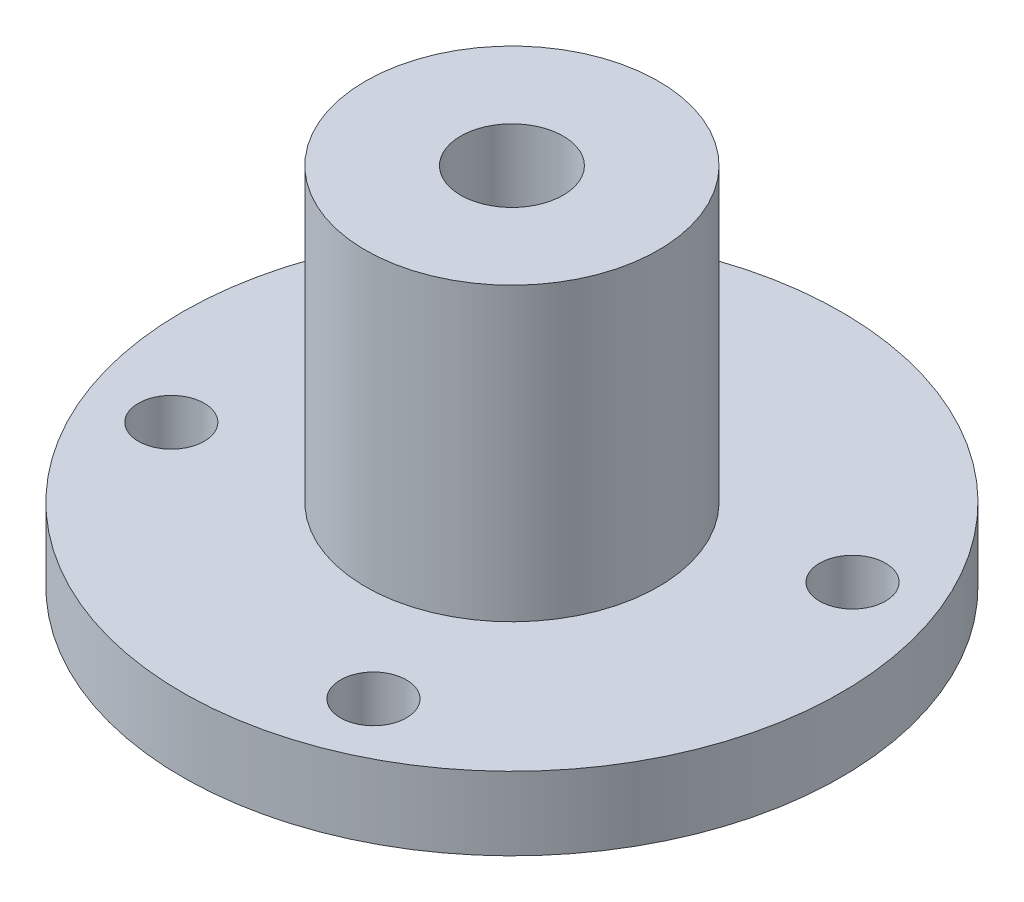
ISO-10303-21;
HEADER;
FILE_DESCRIPTION(('STEP AP214'),'2;1');
FILE_NAME('part.step','',(''),(''),'','','');
FILE_SCHEMA(('AUTOMOTIVE_DESIGN { 1 0 10303 214 1 1 1 1 }'));
ENDSEC;
DATA;
#1=APPLICATION_CONTEXT('core data for automotive mechanical design processes');
#2=APPLICATION_PROTOCOL_DEFINITION('international standard','automotive_design',2000,#1);
#3=PRODUCT_CONTEXT('',#1,'mechanical');
#4=PRODUCT('Part','Part','',(#3));
#5=PRODUCT_RELATED_PRODUCT_CATEGORY('part','',(#4));
#6=PRODUCT_DEFINITION_FORMATION('','',#4);
#7=PRODUCT_DEFINITION_CONTEXT('part definition',#1,'design');
#8=PRODUCT_DEFINITION('design','',#6,#7);
#9=PRODUCT_DEFINITION_SHAPE('','',#8);
#10=(LENGTH_UNIT() NAMED_UNIT(*) SI_UNIT(.MILLI.,.METRE.));
#11=(NAMED_UNIT(*) PLANE_ANGLE_UNIT() SI_UNIT($,.RADIAN.));
#12=(NAMED_UNIT(*) SI_UNIT($,.STERADIAN.) SOLID_ANGLE_UNIT());
#13=UNCERTAINTY_MEASURE_WITH_UNIT(LENGTH_MEASURE(1.E-05),#10,'distance_accuracy_value','');
#14=(GEOMETRIC_REPRESENTATION_CONTEXT(3) GLOBAL_UNCERTAINTY_ASSIGNED_CONTEXT((#13)) GLOBAL_UNIT_ASSIGNED_CONTEXT((#10,
#11,#12)) REPRESENTATION_CONTEXT('',''));
#15=CARTESIAN_POINT('',(0.,0.,0.));
#16=DIRECTION('',(0.,0.,1.));
#17=DIRECTION('',(1.,0.,0.));
#18=AXIS2_PLACEMENT_3D('',#15,#16,#17);
#19=CARTESIAN_POINT('',(20.,49.8,0.));
#20=DIRECTION('',(0.,-1.,0.));
#21=DIRECTION('',(1.,0.,0.));
#22=AXIS2_PLACEMENT_3D('',#19,#20,#21);
#23=PLANE('',#22);
#24=CARTESIAN_POINT('',(0.,49.8,0.));
#25=DIRECTION('',(0.,1.,0.));
#26=DIRECTION('',(0.,0.,1.));
#27=AXIS2_PLACEMENT_3D('',#24,#25,#26);
#28=CIRCLE('',#27,6.99999999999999);
#29=CARTESIAN_POINT('',(0.,49.8,6.99999999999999));
#30=VERTEX_POINT('',#29);
#31=EDGE_CURVE('E56',#30,#30,#28,.T.);
#32=ORIENTED_EDGE('',*,*,#31,.F.);
#33=EDGE_LOOP('',(#32));
#34=FACE_BOUND('',#33,.T.);
#35=CARTESIAN_POINT('',(0.,49.8,0.));
#36=DIRECTION('',(0.,1.,0.));
#37=DIRECTION('',(-1.,0.,0.));
#38=AXIS2_PLACEMENT_3D('',#35,#36,#37);
#39=CIRCLE('',#38,20.);
#40=CARTESIAN_POINT('',(-20.,49.8,0.));
#41=VERTEX_POINT('',#40);
#42=EDGE_CURVE('E53',#41,#41,#39,.T.);
#43=ORIENTED_EDGE('',*,*,#42,.T.);
#44=EDGE_LOOP('',(#43));
#45=FACE_BOUND('',#44,.T.);
#46=ADVANCED_FACE('F31',(#34,#45),#23,.F.);
#47=CARTESIAN_POINT('',(15.,10.,0.));
#48=DIRECTION('',(0.,1.,0.));
#49=DIRECTION('',(-1.,0.,0.));
#50=AXIS2_PLACEMENT_3D('',#47,#48,#49);
#51=PLANE('',#50);
#52=CARTESIAN_POINT('',(0.,10.,0.));
#53=DIRECTION('',(0.,1.,0.));
#54=DIRECTION('',(-1.,0.,0.));
#55=AXIS2_PLACEMENT_3D('',#52,#53,#54);
#56=CIRCLE('',#55,6.99999999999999);
#57=CARTESIAN_POINT('',(-6.99999999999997,10.,0.));
#58=VERTEX_POINT('',#57);
#59=EDGE_CURVE('E34',#58,#58,#56,.T.);
#60=ORIENTED_EDGE('',*,*,#59,.T.);
#61=EDGE_LOOP('',(#60));
#62=FACE_BOUND('',#61,.T.);
#63=CARTESIAN_POINT('',(0.,10.,0.));
#64=DIRECTION('',(0.,1.,0.));
#65=DIRECTION('',(-1.,0.,0.));
#66=AXIS2_PLACEMENT_3D('',#63,#64,#65);
#67=CIRCLE('',#66,15.);
#68=CARTESIAN_POINT('',(-15.,10.,0.));
#69=VERTEX_POINT('',#68);
#70=EDGE_CURVE('E10',#69,#69,#67,.T.);
#71=ORIENTED_EDGE('',*,*,#70,.F.);
#72=EDGE_LOOP('',(#71));
#73=FACE_BOUND('',#72,.T.);
#74=ADVANCED_FACE('F116',(#62,#73),#51,.F.);
#75=CARTESIAN_POINT('',(0.,49.8,0.));
#76=DIRECTION('',(0.,1.,0.));
#77=DIRECTION('',(-1.,0.,0.));
#78=AXIS2_PLACEMENT_3D('',#75,#76,#77);
#79=CYLINDRICAL_SURFACE('',#78,15.);
#80=CARTESIAN_POINT('',(0.,0.,0.));
#81=DIRECTION('',(0.,1.,0.));
#82=DIRECTION('',(-1.,0.,0.));
#83=AXIS2_PLACEMENT_3D('',#80,#81,#82);
#84=CIRCLE('',#83,15.);
#85=CARTESIAN_POINT('',(-15.,0.,0.));
#86=VERTEX_POINT('',#85);
#87=EDGE_CURVE('E38',#86,#86,#84,.T.);
#88=ORIENTED_EDGE('',*,*,#87,.F.);
#89=EDGE_LOOP('',(#88));
#90=FACE_BOUND('',#89,.T.);
#91=ORIENTED_EDGE('',*,*,#70,.T.);
#92=EDGE_LOOP('',(#91));
#93=FACE_BOUND('',#92,.T.);
#94=ADVANCED_FACE('F110',(#90,#93),#79,.F.);
#95=CARTESIAN_POINT('',(15.,0.,0.));
#96=DIRECTION('',(0.,1.,0.));
#97=DIRECTION('',(-1.,0.,0.));
#98=AXIS2_PLACEMENT_3D('',#95,#96,#97);
#99=PLANE('',#98);
#100=CARTESIAN_POINT('',(32.7075348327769,0.,-13.8009842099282));
#101=DIRECTION('',(0.,1.,0.));
#102=DIRECTION('',(0.,0.,1.));
#103=AXIS2_PLACEMENT_3D('',#100,#101,#102);
#104=CIRCLE('',#103,4.5);
#105=CARTESIAN_POINT('',(32.7075348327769,0.,-9.30098420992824));
#106=VERTEX_POINT('',#105);
#107=EDGE_CURVE('E77',#106,#106,#104,.T.);
#108=ORIENTED_EDGE('',*,*,#107,.T.);
#109=EDGE_LOOP('',(#108));
#110=FACE_BOUND('',#109,.T.);
#111=CARTESIAN_POINT('',(13.8009842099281,0.,32.7075348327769));
#112=DIRECTION('',(0.,1.,0.));
#113=DIRECTION('',(0.,0.,1.));
#114=AXIS2_PLACEMENT_3D('',#111,#112,#113);
#115=CIRCLE('',#114,4.5);
#116=CARTESIAN_POINT('',(13.8009842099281,0.,37.2075348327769));
#117=VERTEX_POINT('',#116);
#118=EDGE_CURVE('E71',#117,#117,#115,.T.);
#119=ORIENTED_EDGE('',*,*,#118,.T.);
#120=EDGE_LOOP('',(#119));
#121=FACE_BOUND('',#120,.T.);
#122=CARTESIAN_POINT('',(-32.707534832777,0.,13.800984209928));
#123=DIRECTION('',(0.,1.,0.));
#124=DIRECTION('',(0.,0.,1.));
#125=AXIS2_PLACEMENT_3D('',#122,#123,#124);
#126=CIRCLE('',#125,4.5);
#127=CARTESIAN_POINT('',(-32.707534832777,0.,18.300984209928));
#128=VERTEX_POINT('',#127);
#129=EDGE_CURVE('E65',#128,#128,#126,.T.);
#130=ORIENTED_EDGE('',*,*,#129,.T.);
#131=EDGE_LOOP('',(#130));
#132=FACE_BOUND('',#131,.T.);
#133=CARTESIAN_POINT('',(-13.8009842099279,0.,-32.707534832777));
#134=DIRECTION('',(0.,1.,0.));
#135=DIRECTION('',(0.,0.,1.));
#136=AXIS2_PLACEMENT_3D('',#133,#134,#135);
#137=CIRCLE('',#136,4.5);
#138=CARTESIAN_POINT('',(-13.8009842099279,0.,-28.207534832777));
#139=VERTEX_POINT('',#138);
#140=EDGE_CURVE('E59',#139,#139,#137,.T.);
#141=ORIENTED_EDGE('',*,*,#140,.T.);
#142=EDGE_LOOP('',(#141));
#143=FACE_BOUND('',#142,.T.);
#144=CARTESIAN_POINT('',(0.,0.,0.));
#145=DIRECTION('',(0.,1.,0.));
#146=DIRECTION('',(-1.,0.,0.));
#147=AXIS2_PLACEMENT_3D('',#144,#145,#146);
#148=CIRCLE('',#147,45.);
#149=CARTESIAN_POINT('',(-45.,0.,0.));
#150=VERTEX_POINT('',#149);
#151=EDGE_CURVE('E42',#150,#150,#148,.T.);
#152=ORIENTED_EDGE('',*,*,#151,.F.);
#153=EDGE_LOOP('',(#152));
#154=FACE_BOUND('',#153,.T.);
#155=ORIENTED_EDGE('',*,*,#87,.T.);
#156=EDGE_LOOP('',(#155));
#157=FACE_BOUND('',#156,.T.);
#158=ADVANCED_FACE('F104',(#110,#121,#132,#143,#154,#157),#99,.F.);
#159=CARTESIAN_POINT('',(0.,49.8,0.));
#160=DIRECTION('',(0.,1.,0.));
#161=DIRECTION('',(-1.,0.,0.));
#162=AXIS2_PLACEMENT_3D('',#159,#160,#161);
#163=CYLINDRICAL_SURFACE('',#162,45.);
#164=CARTESIAN_POINT('',(0.,10.,0.));
#165=DIRECTION('',(0.,1.,0.));
#166=DIRECTION('',(-1.,0.,0.));
#167=AXIS2_PLACEMENT_3D('',#164,#165,#166);
#168=CIRCLE('',#167,45.);
#169=CARTESIAN_POINT('',(-45.,10.,0.));
#170=VERTEX_POINT('',#169);
#171=EDGE_CURVE('E47',#170,#170,#168,.T.);
#172=ORIENTED_EDGE('',*,*,#171,.F.);
#173=EDGE_LOOP('',(#172));
#174=FACE_BOUND('',#173,.T.);
#175=ORIENTED_EDGE('',*,*,#151,.T.);
#176=EDGE_LOOP('',(#175));
#177=FACE_BOUND('',#176,.T.);
#178=ADVANCED_FACE('F90',(#174,#177),#163,.T.);
#179=CARTESIAN_POINT('',(45.,10.,0.));
#180=DIRECTION('',(0.,-1.,0.));
#181=DIRECTION('',(1.,0.,0.));
#182=AXIS2_PLACEMENT_3D('',#179,#180,#181);
#183=PLANE('',#182);
#184=CARTESIAN_POINT('',(32.7075348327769,10.,-13.8009842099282));
#185=DIRECTION('',(0.,1.,0.));
#186=DIRECTION('',(0.,0.,1.));
#187=AXIS2_PLACEMENT_3D('',#184,#185,#186);
#188=CIRCLE('',#187,4.5);
#189=CARTESIAN_POINT('',(32.7075348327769,10.,-9.30098420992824));
#190=VERTEX_POINT('',#189);
#191=EDGE_CURVE('E80',#190,#190,#188,.T.);
#192=ORIENTED_EDGE('',*,*,#191,.F.);
#193=EDGE_LOOP('',(#192));
#194=FACE_BOUND('',#193,.T.);
#195=CARTESIAN_POINT('',(13.8009842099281,10.,32.7075348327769));
#196=DIRECTION('',(0.,1.,0.));
#197=DIRECTION('',(0.,0.,1.));
#198=AXIS2_PLACEMENT_3D('',#195,#196,#197);
#199=CIRCLE('',#198,4.5);
#200=CARTESIAN_POINT('',(13.8009842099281,10.,37.2075348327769));
#201=VERTEX_POINT('',#200);
#202=EDGE_CURVE('E74',#201,#201,#199,.T.);
#203=ORIENTED_EDGE('',*,*,#202,.F.);
#204=EDGE_LOOP('',(#203));
#205=FACE_BOUND('',#204,.T.);
#206=CARTESIAN_POINT('',(-32.707534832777,10.,13.800984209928));
#207=DIRECTION('',(0.,1.,0.));
#208=DIRECTION('',(0.,0.,1.));
#209=AXIS2_PLACEMENT_3D('',#206,#207,#208);
#210=CIRCLE('',#209,4.5);
#211=CARTESIAN_POINT('',(-32.707534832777,10.,18.300984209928));
#212=VERTEX_POINT('',#211);
#213=EDGE_CURVE('E68',#212,#212,#210,.T.);
#214=ORIENTED_EDGE('',*,*,#213,.F.);
#215=EDGE_LOOP('',(#214));
#216=FACE_BOUND('',#215,.T.);
#217=CARTESIAN_POINT('',(-13.8009842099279,10.,-32.707534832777));
#218=DIRECTION('',(0.,1.,0.));
#219=DIRECTION('',(0.,0.,1.));
#220=AXIS2_PLACEMENT_3D('',#217,#218,#219);
#221=CIRCLE('',#220,4.5);
#222=CARTESIAN_POINT('',(-13.8009842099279,10.,-28.207534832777));
#223=VERTEX_POINT('',#222);
#224=EDGE_CURVE('E62',#223,#223,#221,.T.);
#225=ORIENTED_EDGE('',*,*,#224,.F.);
#226=EDGE_LOOP('',(#225));
#227=FACE_BOUND('',#226,.T.);
#228=CARTESIAN_POINT('',(0.,10.,0.));
#229=DIRECTION('',(0.,1.,0.));
#230=DIRECTION('',(-1.,0.,0.));
#231=AXIS2_PLACEMENT_3D('',#228,#229,#230);
#232=CIRCLE('',#231,20.);
#233=CARTESIAN_POINT('',(-20.,10.,0.));
#234=VERTEX_POINT('',#233);
#235=EDGE_CURVE('E50',#234,#234,#232,.T.);
#236=ORIENTED_EDGE('',*,*,#235,.F.);
#237=EDGE_LOOP('',(#236));
#238=FACE_BOUND('',#237,.T.);
#239=ORIENTED_EDGE('',*,*,#171,.T.);
#240=EDGE_LOOP('',(#239));
#241=FACE_BOUND('',#240,.T.);
#242=ADVANCED_FACE('F86',(#194,#205,#216,#227,#238,#241),#183,.F.);
#243=CARTESIAN_POINT('',(0.,49.8,0.));
#244=DIRECTION('',(0.,1.,0.));
#245=DIRECTION('',(-1.,0.,0.));
#246=AXIS2_PLACEMENT_3D('',#243,#244,#245);
#247=CYLINDRICAL_SURFACE('',#246,20.);
#248=ORIENTED_EDGE('',*,*,#42,.F.);
#249=EDGE_LOOP('',(#248));
#250=FACE_BOUND('',#249,.T.);
#251=ORIENTED_EDGE('',*,*,#235,.T.);
#252=EDGE_LOOP('',(#251));
#253=FACE_BOUND('',#252,.T.);
#254=ADVANCED_FACE('F89',(#250,#253),#247,.T.);
#255=CARTESIAN_POINT('',(0.,49.8,0.));
#256=DIRECTION('',(0.,1.,0.));
#257=DIRECTION('',(0.,0.,1.));
#258=AXIS2_PLACEMENT_3D('',#255,#256,#257);
#259=CYLINDRICAL_SURFACE('',#258,6.99999999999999);
#260=ORIENTED_EDGE('',*,*,#31,.T.);
#261=EDGE_LOOP('',(#260));
#262=FACE_BOUND('',#261,.T.);
#263=ORIENTED_EDGE('',*,*,#59,.F.);
#264=EDGE_LOOP('',(#263));
#265=FACE_BOUND('',#264,.T.);
#266=ADVANCED_FACE('F132',(#262,#265),#259,.F.);
#267=CARTESIAN_POINT('',(-13.8009842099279,10.,-32.707534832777));
#268=DIRECTION('',(0.,1.,0.));
#269=DIRECTION('',(0.,0.,1.));
#270=AXIS2_PLACEMENT_3D('',#267,#268,#269);
#271=CYLINDRICAL_SURFACE('',#270,4.5);
#272=ORIENTED_EDGE('',*,*,#140,.F.);
#273=EDGE_LOOP('',(#272));
#274=FACE_BOUND('',#273,.T.);
#275=ORIENTED_EDGE('',*,*,#224,.T.);
#276=EDGE_LOOP('',(#275));
#277=FACE_BOUND('',#276,.T.);
#278=ADVANCED_FACE('F137',(#274,#277),#271,.F.);
#279=CARTESIAN_POINT('',(-32.707534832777,10.,13.800984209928));
#280=DIRECTION('',(0.,1.,0.));
#281=DIRECTION('',(0.,0.,1.));
#282=AXIS2_PLACEMENT_3D('',#279,#280,#281);
#283=CYLINDRICAL_SURFACE('',#282,4.5);
#284=ORIENTED_EDGE('',*,*,#129,.F.);
#285=EDGE_LOOP('',(#284));
#286=FACE_BOUND('',#285,.T.);
#287=ORIENTED_EDGE('',*,*,#213,.T.);
#288=EDGE_LOOP('',(#287));
#289=FACE_BOUND('',#288,.T.);
#290=ADVANCED_FACE('F143',(#286,#289),#283,.F.);
#291=CARTESIAN_POINT('',(13.8009842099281,10.,32.7075348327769));
#292=DIRECTION('',(0.,1.,0.));
#293=DIRECTION('',(0.,0.,1.));
#294=AXIS2_PLACEMENT_3D('',#291,#292,#293);
#295=CYLINDRICAL_SURFACE('',#294,4.5);
#296=ORIENTED_EDGE('',*,*,#118,.F.);
#297=EDGE_LOOP('',(#296));
#298=FACE_BOUND('',#297,.T.);
#299=ORIENTED_EDGE('',*,*,#202,.T.);
#300=EDGE_LOOP('',(#299));
#301=FACE_BOUND('',#300,.T.);
#302=ADVANCED_FACE('F147',(#298,#301),#295,.F.);
#303=CARTESIAN_POINT('',(32.7075348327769,10.,-13.8009842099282));
#304=DIRECTION('',(0.,1.,0.));
#305=DIRECTION('',(0.,0.,1.));
#306=AXIS2_PLACEMENT_3D('',#303,#304,#305);
#307=CYLINDRICAL_SURFACE('',#306,4.5);
#308=ORIENTED_EDGE('',*,*,#107,.F.);
#309=EDGE_LOOP('',(#308));
#310=FACE_BOUND('',#309,.T.);
#311=ORIENTED_EDGE('',*,*,#191,.T.);
#312=EDGE_LOOP('',(#311));
#313=FACE_BOUND('',#312,.T.);
#314=ADVANCED_FACE('F84',(#310,#313),#307,.F.);
#315=CLOSED_SHELL('',(#46,#74,#94,#158,#178,#242,#254,#266,#278,#290,#302,#314));
#316=MANIFOLD_SOLID_BREP('B2',#315);
#317=ADVANCED_BREP_SHAPE_REPRESENTATION('',(#18,#316),#14);
#318=SHAPE_DEFINITION_REPRESENTATION(#9,#317);
ENDSEC;
END-ISO-10303-21;
